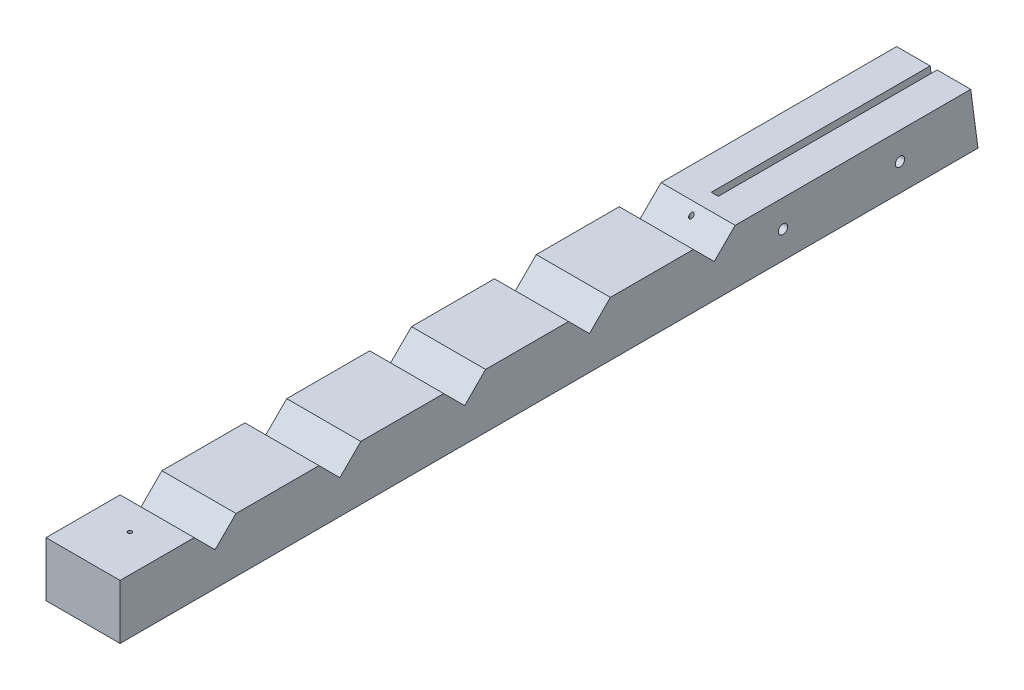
ISO-10303-21;
HEADER;
FILE_DESCRIPTION(('STEP AP214'),'2;1');
FILE_NAME('part.step','',(''),(''),'','','');
FILE_SCHEMA(('AUTOMOTIVE_DESIGN { 1 0 10303 214 1 1 1 1 }'));
ENDSEC;
DATA;
#1=APPLICATION_CONTEXT('core data for automotive mechanical design processes');
#2=APPLICATION_PROTOCOL_DEFINITION('international standard','automotive_design',2000,#1);
#3=PRODUCT_CONTEXT('',#1,'mechanical');
#4=PRODUCT('Part','Part','',(#3));
#5=PRODUCT_RELATED_PRODUCT_CATEGORY('part','',(#4));
#6=PRODUCT_DEFINITION_FORMATION('','',#4);
#7=PRODUCT_DEFINITION_CONTEXT('part definition',#1,'design');
#8=PRODUCT_DEFINITION('design','',#6,#7);
#9=PRODUCT_DEFINITION_SHAPE('','',#8);
#10=(LENGTH_UNIT() NAMED_UNIT(*) SI_UNIT(.MILLI.,.METRE.));
#11=(NAMED_UNIT(*) PLANE_ANGLE_UNIT() SI_UNIT($,.RADIAN.));
#12=(NAMED_UNIT(*) SI_UNIT($,.STERADIAN.) SOLID_ANGLE_UNIT());
#13=UNCERTAINTY_MEASURE_WITH_UNIT(LENGTH_MEASURE(1.E-05),#10,'distance_accuracy_value','');
#14=(GEOMETRIC_REPRESENTATION_CONTEXT(3) GLOBAL_UNCERTAINTY_ASSIGNED_CONTEXT((#13)) GLOBAL_UNIT_ASSIGNED_CONTEXT((#10,
#11,#12)) REPRESENTATION_CONTEXT('',''));
#15=CARTESIAN_POINT('',(0.,0.,0.));
#16=DIRECTION('',(0.,0.,1.));
#17=DIRECTION('',(1.,0.,0.));
#18=AXIS2_PLACEMENT_3D('',#15,#16,#17);
#19=CARTESIAN_POINT('',(-47.5,-5.,1100.));
#20=DIRECTION('',(0.,-1.,0.));
#21=DIRECTION('',(1.,0.,0.));
#22=AXIS2_PLACEMENT_3D('',#19,#20,#21);
#23=PLANE('',#22);
#24=DIRECTION('',(1.,0.,0.));
#25=VECTOR('',#24,1.);
#26=CARTESIAN_POINT('',(-47.5,-5.,9.33333333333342));
#27=LINE('',#26,#25);
#28=CARTESIAN_POINT('',(-47.5,-5.,9.33333333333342));
#29=VERTEX_POINT('',#28);
#30=CARTESIAN_POINT('',(-4.5,-5.00000000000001,9.33333333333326));
#31=VERTEX_POINT('',#30);
#32=EDGE_CURVE('E41',#29,#31,#27,.T.);
#33=ORIENTED_EDGE('',*,*,#32,.F.);
#34=DIRECTION('',(0.,0.,-1.));
#35=VECTOR('',#34,1.);
#36=CARTESIAN_POINT('',(-47.5,-5.,1100.));
#37=LINE('',#36,#35);
#38=CARTESIAN_POINT('',(-47.5,-4.99999999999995,311.360389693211));
#39=VERTEX_POINT('',#38);
#40=EDGE_CURVE('E213',#39,#29,#37,.T.);
#41=ORIENTED_EDGE('',*,*,#40,.F.);
#42=DIRECTION('',(-1.,0.,0.));
#43=VECTOR('',#42,1.);
#44=CARTESIAN_POINT('',(-47.5,-5.,311.360389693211));
#45=LINE('',#44,#43);
#46=CARTESIAN_POINT('',(47.5,-4.99999999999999,311.360389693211));
#47=VERTEX_POINT('',#46);
#48=EDGE_CURVE('E293',#47,#39,#45,.T.);
#49=ORIENTED_EDGE('',*,*,#48,.F.);
#50=DIRECTION('',(0.,0.,-1.));
#51=VECTOR('',#50,1.);
#52=CARTESIAN_POINT('',(47.5,-4.99999999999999,1100.));
#53=LINE('',#52,#51);
#54=CARTESIAN_POINT('',(47.5,-4.99999999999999,9.33333333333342));
#55=VERTEX_POINT('',#54);
#56=EDGE_CURVE('E222',#47,#55,#53,.T.);
#57=ORIENTED_EDGE('',*,*,#56,.T.);
#58=CARTESIAN_POINT('',(4.5,-4.99999999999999,9.33333333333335));
#59=VERTEX_POINT('',#58);
#60=EDGE_CURVE('E186',#59,#55,#27,.T.);
#61=ORIENTED_EDGE('',*,*,#60,.F.);
#62=DIRECTION('',(0.,0.,-1.));
#63=VECTOR('',#62,1.);
#64=CARTESIAN_POINT('',(4.5,-5.,1100.));
#65=LINE('',#64,#63);
#66=CARTESIAN_POINT('',(4.5,-5.,290.));
#67=VERTEX_POINT('',#66);
#68=EDGE_CURVE('E245',#67,#59,#65,.T.);
#69=ORIENTED_EDGE('',*,*,#68,.F.);
#70=DIRECTION('',(-1.,0.,0.));
#71=VECTOR('',#70,1.);
#72=CARTESIAN_POINT('',(-47.5,-5.,290.));
#73=LINE('',#72,#71);
#74=CARTESIAN_POINT('',(-4.5,-5.,290.));
#75=VERTEX_POINT('',#74);
#76=EDGE_CURVE('E261',#67,#75,#73,.T.);
#77=ORIENTED_EDGE('',*,*,#76,.T.);
#78=DIRECTION('',(0.,0.,1.));
#79=VECTOR('',#78,1.);
#80=CARTESIAN_POINT('',(-4.5,-5.,1100.));
#81=LINE('',#80,#79);
#82=EDGE_CURVE('E249',#31,#75,#81,.T.);
#83=ORIENTED_EDGE('',*,*,#82,.F.);
#84=EDGE_LOOP('',(#33,#41,#49,#57,#61,#69,#77,#83));
#85=FACE_BOUND('',#84,.T.);
#86=ADVANCED_FACE('F26',(#85),#23,.F.);
#87=CARTESIAN_POINT('',(47.5,-4.99999999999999,1100.));
#88=DIRECTION('',(-1.,0.,0.));
#89=DIRECTION('',(0.,-1.,0.));
#90=AXIS2_PLACEMENT_3D('',#87,#88,#89);
#91=PLANE('',#90);
#92=CARTESIAN_POINT('',(47.5,-40.,250.));
#93=DIRECTION('',(1.,0.,0.));
#94=DIRECTION('',(0.,0.,-1.));
#95=AXIS2_PLACEMENT_3D('',#92,#93,#94);
#96=CIRCLE('',#95,6.00000000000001);
#97=CARTESIAN_POINT('',(47.5,-40.,244.));
#98=VERTEX_POINT('',#97);
#99=EDGE_CURVE('E267',#98,#98,#96,.T.);
#100=ORIENTED_EDGE('',*,*,#99,.F.);
#101=EDGE_LOOP('',(#100));
#102=FACE_BOUND('',#101,.T.);
#103=CARTESIAN_POINT('',(47.5,-40.,100.));
#104=DIRECTION('',(1.,0.,0.));
#105=DIRECTION('',(0.,0.,-1.));
#106=AXIS2_PLACEMENT_3D('',#103,#104,#105);
#107=CIRCLE('',#106,5.99999999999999);
#108=CARTESIAN_POINT('',(47.5,-40.,94.));
#109=VERTEX_POINT('',#108);
#110=EDGE_CURVE('E273',#109,#109,#107,.T.);
#111=ORIENTED_EDGE('',*,*,#110,.F.);
#112=EDGE_LOOP('',(#111));
#113=FACE_BOUND('',#112,.T.);
#114=DIRECTION('',(0.,-0.991227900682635,-0.132163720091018));
#115=VECTOR('',#114,1.);
#116=CARTESIAN_POINT('',(47.5,137.882096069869,28.3842794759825));
#117=LINE('',#116,#115);
#118=CARTESIAN_POINT('',(47.5000000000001,-75.,0.));
#119=VERTEX_POINT('',#118);
#120=EDGE_CURVE('E181',#55,#119,#117,.T.);
#121=ORIENTED_EDGE('',*,*,#120,.F.);
#122=ORIENTED_EDGE('',*,*,#56,.F.);
#123=DIRECTION('',(0.,0.707106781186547,-0.707106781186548));
#124=VECTOR('',#123,1.);
#125=CARTESIAN_POINT('',(47.5,0.,306.360389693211));
#126=LINE('',#125,#124);
#127=CARTESIAN_POINT('',(47.5,-31.8198051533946,338.180194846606));
#128=VERTEX_POINT('',#127);
#129=EDGE_CURVE('E296',#128,#47,#126,.T.);
#130=ORIENTED_EDGE('',*,*,#129,.F.);
#131=DIRECTION('',(0.,-0.707106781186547,-0.707106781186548));
#132=VECTOR('',#131,1.);
#133=CARTESIAN_POINT('',(47.5,-31.8198051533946,338.180194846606));
#134=LINE('',#133,#132);
#135=CARTESIAN_POINT('',(47.5,-4.99999999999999,365.));
#136=VERTEX_POINT('',#135);
#137=EDGE_CURVE('E287',#136,#128,#134,.T.);
#138=ORIENTED_EDGE('',*,*,#137,.F.);
#139=CARTESIAN_POINT('',(47.5,-4.99999999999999,471.360389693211));
#140=VERTEX_POINT('',#139);
#141=EDGE_CURVE('E397',#140,#136,#53,.T.);
#142=ORIENTED_EDGE('',*,*,#141,.F.);
#143=DIRECTION('',(0.,0.707106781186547,-0.707106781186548));
#144=VECTOR('',#143,1.);
#145=CARTESIAN_POINT('',(47.5,0.,466.360389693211));
#146=LINE('',#145,#144);
#147=CARTESIAN_POINT('',(47.5,-31.8198051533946,498.180194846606));
#148=VERTEX_POINT('',#147);
#149=EDGE_CURVE('E312',#148,#140,#146,.T.);
#150=ORIENTED_EDGE('',*,*,#149,.F.);
#151=DIRECTION('',(0.,-0.707106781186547,-0.707106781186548));
#152=VECTOR('',#151,1.);
#153=CARTESIAN_POINT('',(47.5,-31.8198051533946,498.180194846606));
#154=LINE('',#153,#152);
#155=CARTESIAN_POINT('',(47.5,-4.99999999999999,525.));
#156=VERTEX_POINT('',#155);
#157=EDGE_CURVE('E300',#156,#148,#154,.T.);
#158=ORIENTED_EDGE('',*,*,#157,.F.);
#159=CARTESIAN_POINT('',(47.5,-4.99999999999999,631.360389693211));
#160=VERTEX_POINT('',#159);
#161=EDGE_CURVE('E399',#160,#156,#53,.T.);
#162=ORIENTED_EDGE('',*,*,#161,.F.);
#163=DIRECTION('',(0.,0.707106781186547,-0.707106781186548));
#164=VECTOR('',#163,1.);
#165=CARTESIAN_POINT('',(47.5,0.,626.360389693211));
#166=LINE('',#165,#164);
#167=CARTESIAN_POINT('',(47.5,-31.8198051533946,658.180194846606));
#168=VERTEX_POINT('',#167);
#169=EDGE_CURVE('E328',#168,#160,#166,.T.);
#170=ORIENTED_EDGE('',*,*,#169,.F.);
#171=DIRECTION('',(0.,-0.707106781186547,-0.707106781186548));
#172=VECTOR('',#171,1.);
#173=CARTESIAN_POINT('',(47.5,-31.8198051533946,658.180194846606));
#174=LINE('',#173,#172);
#175=CARTESIAN_POINT('',(47.5,-4.99999999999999,685.));
#176=VERTEX_POINT('',#175);
#177=EDGE_CURVE('E316',#176,#168,#174,.T.);
#178=ORIENTED_EDGE('',*,*,#177,.F.);
#179=CARTESIAN_POINT('',(47.5,-4.99999999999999,791.360389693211));
#180=VERTEX_POINT('',#179);
#181=EDGE_CURVE('E405',#180,#176,#53,.T.);
#182=ORIENTED_EDGE('',*,*,#181,.F.);
#183=DIRECTION('',(0.,0.707106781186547,-0.707106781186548));
#184=VECTOR('',#183,1.);
#185=CARTESIAN_POINT('',(47.5,0.,786.360389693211));
#186=LINE('',#185,#184);
#187=CARTESIAN_POINT('',(47.5,-31.8198051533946,818.180194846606));
#188=VERTEX_POINT('',#187);
#189=EDGE_CURVE('E344',#188,#180,#186,.T.);
#190=ORIENTED_EDGE('',*,*,#189,.F.);
#191=DIRECTION('',(0.,-0.707106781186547,-0.707106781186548));
#192=VECTOR('',#191,1.);
#193=CARTESIAN_POINT('',(47.5,-31.8198051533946,818.180194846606));
#194=LINE('',#193,#192);
#195=CARTESIAN_POINT('',(47.5,-4.99999999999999,845.));
#196=VERTEX_POINT('',#195);
#197=EDGE_CURVE('E332',#196,#188,#194,.T.);
#198=ORIENTED_EDGE('',*,*,#197,.F.);
#199=CARTESIAN_POINT('',(47.5,-4.99999999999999,951.360389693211));
#200=VERTEX_POINT('',#199);
#201=EDGE_CURVE('E227',#200,#196,#53,.T.);
#202=ORIENTED_EDGE('',*,*,#201,.F.);
#203=DIRECTION('',(0.,0.707106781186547,-0.707106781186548));
#204=VECTOR('',#203,1.);
#205=CARTESIAN_POINT('',(47.5,0.,946.360389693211));
#206=LINE('',#205,#204);
#207=CARTESIAN_POINT('',(47.5,-31.8198051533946,978.180194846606));
#208=VERTEX_POINT('',#207);
#209=EDGE_CURVE('E349',#208,#200,#206,.T.);
#210=ORIENTED_EDGE('',*,*,#209,.F.);
#211=DIRECTION('',(0.,-0.707106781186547,-0.707106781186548));
#212=VECTOR('',#211,1.);
#213=CARTESIAN_POINT('',(47.5,-31.8198051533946,978.180194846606));
#214=LINE('',#213,#212);
#215=CARTESIAN_POINT('',(47.5,-4.99999999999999,1005.));
#216=VERTEX_POINT('',#215);
#217=EDGE_CURVE('E351',#216,#208,#214,.T.);
#218=ORIENTED_EDGE('',*,*,#217,.F.);
#219=CARTESIAN_POINT('',(47.5,-4.99999999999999,1100.));
#220=VERTEX_POINT('',#219);
#221=EDGE_CURVE('E224',#220,#216,#53,.T.);
#222=ORIENTED_EDGE('',*,*,#221,.F.);
#223=DIRECTION('',(0.,1.,0.));
#224=VECTOR('',#223,1.);
#225=CARTESIAN_POINT('',(47.5,-4.99999999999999,1100.));
#226=LINE('',#225,#224);
#227=CARTESIAN_POINT('',(47.5,-75.,1100.));
#228=VERTEX_POINT('',#227);
#229=EDGE_CURVE('E208',#228,#220,#226,.T.);
#230=ORIENTED_EDGE('',*,*,#229,.F.);
#231=DIRECTION('',(0.,0.,-1.));
#232=VECTOR('',#231,1.);
#233=CARTESIAN_POINT('',(47.5,-75.,1100.));
#234=LINE('',#233,#232);
#235=EDGE_CURVE('E199',#228,#119,#234,.T.);
#236=ORIENTED_EDGE('',*,*,#235,.T.);
#237=EDGE_LOOP('',(#121,#122,#130,#138,#142,#150,#158,#162,#170,#178,#182,#190,#198,#202,#210,
#218,#222,#230,#236));
#238=FACE_BOUND('',#237,.T.);
#239=ADVANCED_FACE('F28',(#102,#113,#238),#91,.F.);
#240=CARTESIAN_POINT('',(-47.5,-5.,1100.));
#241=DIRECTION('',(1.,0.,0.));
#242=DIRECTION('',(0.,0.,-1.));
#243=AXIS2_PLACEMENT_3D('',#240,#241,#242);
#244=PLANE('',#243);
#245=CARTESIAN_POINT('',(-47.5,-40.,250.));
#246=DIRECTION('',(1.,0.,0.));
#247=DIRECTION('',(0.,0.,-1.));
#248=AXIS2_PLACEMENT_3D('',#245,#246,#247);
#249=CIRCLE('',#248,6.00000000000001);
#250=CARTESIAN_POINT('',(-47.5,-40.,244.));
#251=VERTEX_POINT('',#250);
#252=EDGE_CURVE('E264',#251,#251,#249,.T.);
#253=ORIENTED_EDGE('',*,*,#252,.T.);
#254=EDGE_LOOP('',(#253));
#255=FACE_BOUND('',#254,.T.);
#256=CARTESIAN_POINT('',(-47.5,-40.,100.));
#257=DIRECTION('',(1.,0.,0.));
#258=DIRECTION('',(0.,0.,-1.));
#259=AXIS2_PLACEMENT_3D('',#256,#257,#258);
#260=CIRCLE('',#259,5.99999999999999);
#261=CARTESIAN_POINT('',(-47.5,-40.,94.));
#262=VERTEX_POINT('',#261);
#263=EDGE_CURVE('E270',#262,#262,#260,.T.);
#264=ORIENTED_EDGE('',*,*,#263,.T.);
#265=EDGE_LOOP('',(#264));
#266=FACE_BOUND('',#265,.T.);
#267=DIRECTION('',(0.,0.991227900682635,0.132163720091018));
#268=VECTOR('',#267,1.);
#269=CARTESIAN_POINT('',(-47.5,137.882096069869,28.3842794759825));
#270=LINE('',#269,#268);
#271=CARTESIAN_POINT('',(-47.5000000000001,-75.,0.));
#272=VERTEX_POINT('',#271);
#273=EDGE_CURVE('E371',#272,#29,#270,.T.);
#274=ORIENTED_EDGE('',*,*,#273,.F.);
#275=DIRECTION('',(0.,0.,-1.));
#276=VECTOR('',#275,1.);
#277=CARTESIAN_POINT('',(-47.5,-75.,1100.));
#278=LINE('',#277,#276);
#279=CARTESIAN_POINT('',(-47.5,-75.,1100.));
#280=VERTEX_POINT('',#279);
#281=EDGE_CURVE('E209',#280,#272,#278,.T.);
#282=ORIENTED_EDGE('',*,*,#281,.F.);
#283=DIRECTION('',(0.,-1.,0.));
#284=VECTOR('',#283,1.);
#285=CARTESIAN_POINT('',(-47.5,-5.,1100.));
#286=LINE('',#285,#284);
#287=CARTESIAN_POINT('',(-47.5,-5.,1100.));
#288=VERTEX_POINT('',#287);
#289=EDGE_CURVE('E215',#288,#280,#286,.T.);
#290=ORIENTED_EDGE('',*,*,#289,.F.);
#291=CARTESIAN_POINT('',(-47.5,-4.99999999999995,1005.));
#292=VERTEX_POINT('',#291);
#293=EDGE_CURVE('E219',#288,#292,#37,.T.);
#294=ORIENTED_EDGE('',*,*,#293,.T.);
#295=DIRECTION('',(0.,0.707106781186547,0.707106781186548));
#296=VECTOR('',#295,1.);
#297=CARTESIAN_POINT('',(-47.5,42.4999999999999,1052.5));
#298=LINE('',#297,#296);
#299=CARTESIAN_POINT('',(-47.5,-31.8198051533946,978.180194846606));
#300=VERTEX_POINT('',#299);
#301=EDGE_CURVE('E34',#300,#292,#298,.T.);
#302=ORIENTED_EDGE('',*,*,#301,.F.);
#303=DIRECTION('',(0.,0.707106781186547,-0.707106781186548));
#304=VECTOR('',#303,1.);
#305=CARTESIAN_POINT('',(-47.5,0.,946.360389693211));
#306=LINE('',#305,#304);
#307=CARTESIAN_POINT('',(-47.5,-4.99999999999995,951.360389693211));
#308=VERTEX_POINT('',#307);
#309=EDGE_CURVE('E346',#300,#308,#306,.T.);
#310=ORIENTED_EDGE('',*,*,#309,.T.);
#311=CARTESIAN_POINT('',(-47.5,-4.99999999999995,845.));
#312=VERTEX_POINT('',#311);
#313=EDGE_CURVE('E223',#308,#312,#37,.T.);
#314=ORIENTED_EDGE('',*,*,#313,.T.);
#315=DIRECTION('',(0.,0.707106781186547,0.707106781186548));
#316=VECTOR('',#315,1.);
#317=CARTESIAN_POINT('',(-47.5,42.4999999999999,892.5));
#318=LINE('',#317,#316);
#319=CARTESIAN_POINT('',(-47.5,-31.8198051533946,818.180194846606));
#320=VERTEX_POINT('',#319);
#321=EDGE_CURVE('E337',#320,#312,#318,.T.);
#322=ORIENTED_EDGE('',*,*,#321,.F.);
#323=DIRECTION('',(0.,0.707106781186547,-0.707106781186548));
#324=VECTOR('',#323,1.);
#325=CARTESIAN_POINT('',(-47.5,0.,786.360389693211));
#326=LINE('',#325,#324);
#327=CARTESIAN_POINT('',(-47.5,-4.99999999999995,791.360389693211));
#328=VERTEX_POINT('',#327);
#329=EDGE_CURVE('E341',#320,#328,#326,.T.);
#330=ORIENTED_EDGE('',*,*,#329,.T.);
#331=CARTESIAN_POINT('',(-47.5,-4.99999999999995,685.));
#332=VERTEX_POINT('',#331);
#333=EDGE_CURVE('E436',#328,#332,#37,.T.);
#334=ORIENTED_EDGE('',*,*,#333,.T.);
#335=DIRECTION('',(0.,0.707106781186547,0.707106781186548));
#336=VECTOR('',#335,1.);
#337=CARTESIAN_POINT('',(-47.5,42.4999999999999,732.5));
#338=LINE('',#337,#336);
#339=CARTESIAN_POINT('',(-47.5,-31.8198051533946,658.180194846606));
#340=VERTEX_POINT('',#339);
#341=EDGE_CURVE('E321',#340,#332,#338,.T.);
#342=ORIENTED_EDGE('',*,*,#341,.F.);
#343=DIRECTION('',(0.,0.707106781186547,-0.707106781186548));
#344=VECTOR('',#343,1.);
#345=CARTESIAN_POINT('',(-47.5,0.,626.360389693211));
#346=LINE('',#345,#344);
#347=CARTESIAN_POINT('',(-47.5,-4.99999999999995,631.360389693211));
#348=VERTEX_POINT('',#347);
#349=EDGE_CURVE('E325',#340,#348,#346,.T.);
#350=ORIENTED_EDGE('',*,*,#349,.T.);
#351=CARTESIAN_POINT('',(-47.5,-4.99999999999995,525.));
#352=VERTEX_POINT('',#351);
#353=EDGE_CURVE('E438',#348,#352,#37,.T.);
#354=ORIENTED_EDGE('',*,*,#353,.T.);
#355=DIRECTION('',(0.,0.707106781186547,0.707106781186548));
#356=VECTOR('',#355,1.);
#357=CARTESIAN_POINT('',(-47.5,42.4999999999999,572.5));
#358=LINE('',#357,#356);
#359=CARTESIAN_POINT('',(-47.5,-31.8198051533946,498.180194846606));
#360=VERTEX_POINT('',#359);
#361=EDGE_CURVE('E305',#360,#352,#358,.T.);
#362=ORIENTED_EDGE('',*,*,#361,.F.);
#363=DIRECTION('',(0.,0.707106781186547,-0.707106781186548));
#364=VECTOR('',#363,1.);
#365=CARTESIAN_POINT('',(-47.5,0.,466.360389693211));
#366=LINE('',#365,#364);
#367=CARTESIAN_POINT('',(-47.5,-4.99999999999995,471.360389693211));
#368=VERTEX_POINT('',#367);
#369=EDGE_CURVE('E309',#360,#368,#366,.T.);
#370=ORIENTED_EDGE('',*,*,#369,.T.);
#371=CARTESIAN_POINT('',(-47.5,-4.99999999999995,365.));
#372=VERTEX_POINT('',#371);
#373=EDGE_CURVE('E440',#368,#372,#37,.T.);
#374=ORIENTED_EDGE('',*,*,#373,.T.);
#375=DIRECTION('',(0.,0.707106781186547,0.707106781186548));
#376=VECTOR('',#375,1.);
#377=CARTESIAN_POINT('',(-47.5,42.4999999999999,412.5));
#378=LINE('',#377,#376);
#379=CARTESIAN_POINT('',(-47.5,-31.8198051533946,338.180194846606));
#380=VERTEX_POINT('',#379);
#381=EDGE_CURVE('E291',#380,#372,#378,.T.);
#382=ORIENTED_EDGE('',*,*,#381,.F.);
#383=DIRECTION('',(0.,0.707106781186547,-0.707106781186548));
#384=VECTOR('',#383,1.);
#385=CARTESIAN_POINT('',(-47.5,0.,306.360389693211));
#386=LINE('',#385,#384);
#387=EDGE_CURVE('E49',#380,#39,#386,.T.);
#388=ORIENTED_EDGE('',*,*,#387,.T.);
#389=ORIENTED_EDGE('',*,*,#40,.T.);
#390=EDGE_LOOP('',(#274,#282,#290,#294,#302,#310,#314,#322,#330,#334,#342,#350,#354,#362,#370,
#374,#382,#388,#389));
#391=FACE_BOUND('',#390,.T.);
#392=ADVANCED_FACE('F369',(#255,#266,#391),#244,.F.);
#393=CARTESIAN_POINT('',(-4.5,75.,290.));
#394=DIRECTION('',(1.,0.,0.));
#395=DIRECTION('',(0.,0.,-1.));
#396=AXIS2_PLACEMENT_3D('',#393,#394,#395);
#397=PLANE('',#396);
#398=CARTESIAN_POINT('',(-4.5,-40.,100.));
#399=DIRECTION('',(1.,0.,0.));
#400=DIRECTION('',(0.,0.,-1.));
#401=AXIS2_PLACEMENT_3D('',#398,#399,#400);
#402=CIRCLE('',#401,5.99999999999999);
#403=CARTESIAN_POINT('',(-4.5,-40.,94.));
#404=VERTEX_POINT('',#403);
#405=EDGE_CURVE('E244',#404,#404,#402,.T.);
#406=ORIENTED_EDGE('',*,*,#405,.F.);
#407=EDGE_LOOP('',(#406));
#408=FACE_BOUND('',#407,.T.);
#409=CARTESIAN_POINT('',(-4.5,-40.,250.));
#410=DIRECTION('',(1.,0.,0.));
#411=DIRECTION('',(0.,0.,-1.));
#412=AXIS2_PLACEMENT_3D('',#409,#410,#411);
#413=CIRCLE('',#412,6.00000000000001);
#414=CARTESIAN_POINT('',(-4.5,-40.,244.));
#415=VERTEX_POINT('',#414);
#416=EDGE_CURVE('E242',#415,#415,#413,.T.);
#417=ORIENTED_EDGE('',*,*,#416,.F.);
#418=EDGE_LOOP('',(#417));
#419=FACE_BOUND('',#418,.T.);
#420=DIRECTION('',(0.,0.,-1.));
#421=VECTOR('',#420,1.);
#422=CARTESIAN_POINT('',(-4.5,-75.,290.));
#423=LINE('',#422,#421);
#424=CARTESIAN_POINT('',(-4.5,-75.,290.));
#425=VERTEX_POINT('',#424);
#426=CARTESIAN_POINT('',(-4.49999999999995,-75.,0.));
#427=VERTEX_POINT('',#426);
#428=EDGE_CURVE('E241',#425,#427,#423,.T.);
#429=ORIENTED_EDGE('',*,*,#428,.T.);
#430=DIRECTION('',(0.,0.991227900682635,0.132163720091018));
#431=VECTOR('',#430,1.);
#432=CARTESIAN_POINT('',(-4.5,110.371179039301,24.7161572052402));
#433=LINE('',#432,#431);
#434=EDGE_CURVE('E191',#427,#31,#433,.T.);
#435=ORIENTED_EDGE('',*,*,#434,.T.);
#436=ORIENTED_EDGE('',*,*,#82,.T.);
#437=DIRECTION('',(0.,-1.,0.));
#438=VECTOR('',#437,1.);
#439=CARTESIAN_POINT('',(-4.5,75.,290.));
#440=LINE('',#439,#438);
#441=EDGE_CURVE('E379',#75,#425,#440,.T.);
#442=ORIENTED_EDGE('',*,*,#441,.T.);
#443=EDGE_LOOP('',(#429,#435,#436,#442));
#444=FACE_BOUND('',#443,.T.);
#445=ADVANCED_FACE('F377',(#408,#419,#444),#397,.T.);
#446=CARTESIAN_POINT('',(4.5,-75.,290.));
#447=DIRECTION('',(-1.,0.,0.));
#448=DIRECTION('',(0.,0.,1.));
#449=AXIS2_PLACEMENT_3D('',#446,#447,#448);
#450=PLANE('',#449);
#451=CARTESIAN_POINT('',(4.5,-40.,100.));
#452=DIRECTION('',(-1.,0.,0.));
#453=DIRECTION('',(0.,0.,1.));
#454=AXIS2_PLACEMENT_3D('',#451,#452,#453);
#455=CIRCLE('',#454,5.99999999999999);
#456=CARTESIAN_POINT('',(4.5,-40.,106.));
#457=VERTEX_POINT('',#456);
#458=EDGE_CURVE('E240',#457,#457,#455,.T.);
#459=ORIENTED_EDGE('',*,*,#458,.F.);
#460=EDGE_LOOP('',(#459));
#461=FACE_BOUND('',#460,.T.);
#462=CARTESIAN_POINT('',(4.5,-40.,250.));
#463=DIRECTION('',(-1.,0.,0.));
#464=DIRECTION('',(0.,0.,1.));
#465=AXIS2_PLACEMENT_3D('',#462,#463,#464);
#466=CIRCLE('',#465,6.00000000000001);
#467=CARTESIAN_POINT('',(4.5,-40.,256.));
#468=VERTEX_POINT('',#467);
#469=EDGE_CURVE('E238',#468,#468,#466,.T.);
#470=ORIENTED_EDGE('',*,*,#469,.F.);
#471=EDGE_LOOP('',(#470));
#472=FACE_BOUND('',#471,.T.);
#473=ORIENTED_EDGE('',*,*,#68,.T.);
#474=DIRECTION('',(0.,-0.991227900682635,-0.132163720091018));
#475=VECTOR('',#474,1.);
#476=CARTESIAN_POINT('',(4.5,-37.0087336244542,5.06550218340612));
#477=LINE('',#476,#475);
#478=CARTESIAN_POINT('',(4.5,-75.,0.));
#479=VERTEX_POINT('',#478);
#480=EDGE_CURVE('E11',#59,#479,#477,.T.);
#481=ORIENTED_EDGE('',*,*,#480,.T.);
#482=DIRECTION('',(0.,0.,-1.));
#483=VECTOR('',#482,1.);
#484=CARTESIAN_POINT('',(4.5,-75.,290.));
#485=LINE('',#484,#483);
#486=CARTESIAN_POINT('',(4.5,-75.,290.));
#487=VERTEX_POINT('',#486);
#488=EDGE_CURVE('E202',#487,#479,#485,.T.);
#489=ORIENTED_EDGE('',*,*,#488,.F.);
#490=DIRECTION('',(0.,1.,0.));
#491=VECTOR('',#490,1.);
#492=CARTESIAN_POINT('',(4.5,-75.,290.));
#493=LINE('',#492,#491);
#494=EDGE_CURVE('E381',#487,#67,#493,.T.);
#495=ORIENTED_EDGE('',*,*,#494,.T.);
#496=EDGE_LOOP('',(#473,#481,#489,#495));
#497=FACE_BOUND('',#496,.T.);
#498=ADVANCED_FACE('F392',(#461,#472,#497),#450,.T.);
#499=CARTESIAN_POINT('',(47.5,-75.,1100.));
#500=DIRECTION('',(0.,1.,0.));
#501=DIRECTION('',(-1.,0.,0.));
#502=AXIS2_PLACEMENT_3D('',#499,#500,#501);
#503=PLANE('',#502);
#504=CARTESIAN_POINT('',(0.,-75.,1040.));
#505=DIRECTION('',(0.,1.,0.));
#506=DIRECTION('',(-1.,0.,0.));
#507=AXIS2_PLACEMENT_3D('',#504,#505,#506);
#508=CIRCLE('',#507,2.49999999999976);
#509=CARTESIAN_POINT('',(-2.49999999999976,-75.,1040.));
#510=VERTEX_POINT('',#509);
#511=EDGE_CURVE('E232',#510,#510,#508,.F.);
#512=ORIENTED_EDGE('',*,*,#511,.F.);
#513=EDGE_LOOP('',(#512));
#514=FACE_BOUND('',#513,.T.);
#515=CARTESIAN_POINT('',(0.,-75.,680.));
#516=DIRECTION('',(0.,1.,0.));
#517=DIRECTION('',(-1.,0.,0.));
#518=AXIS2_PLACEMENT_3D('',#515,#516,#517);
#519=CIRCLE('',#518,2.49999999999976);
#520=CARTESIAN_POINT('',(-2.49999999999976,-75.,680.));
#521=VERTEX_POINT('',#520);
#522=EDGE_CURVE('E233',#521,#521,#519,.F.);
#523=ORIENTED_EDGE('',*,*,#522,.F.);
#524=EDGE_LOOP('',(#523));
#525=FACE_BOUND('',#524,.T.);
#526=CARTESIAN_POINT('',(0.,-75.,320.));
#527=DIRECTION('',(0.,1.,0.));
#528=DIRECTION('',(-1.,0.,0.));
#529=AXIS2_PLACEMENT_3D('',#526,#527,#528);
#530=CIRCLE('',#529,2.49999999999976);
#531=CARTESIAN_POINT('',(-2.49999999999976,-75.,320.));
#532=VERTEX_POINT('',#531);
#533=EDGE_CURVE('E237',#532,#532,#530,.F.);
#534=ORIENTED_EDGE('',*,*,#533,.F.);
#535=EDGE_LOOP('',(#534));
#536=FACE_BOUND('',#535,.T.);
#537=ORIENTED_EDGE('',*,*,#428,.F.);
#538=DIRECTION('',(1.,0.,0.));
#539=VECTOR('',#538,1.);
#540=CARTESIAN_POINT('',(-4.5,-75.,290.));
#541=LINE('',#540,#539);
#542=EDGE_CURVE('E385',#425,#487,#541,.T.);
#543=ORIENTED_EDGE('',*,*,#542,.T.);
#544=ORIENTED_EDGE('',*,*,#488,.T.);
#545=DIRECTION('',(1.,0.,0.));
#546=VECTOR('',#545,1.);
#547=CARTESIAN_POINT('',(47.5,-75.,0.));
#548=LINE('',#547,#546);
#549=EDGE_CURVE('E184',#479,#119,#548,.T.);
#550=ORIENTED_EDGE('',*,*,#549,.T.);
#551=ORIENTED_EDGE('',*,*,#235,.F.);
#552=DIRECTION('',(1.,0.,0.));
#553=VECTOR('',#552,1.);
#554=CARTESIAN_POINT('',(47.5,-75.,1100.));
#555=LINE('',#554,#553);
#556=EDGE_CURVE('E210',#280,#228,#555,.T.);
#557=ORIENTED_EDGE('',*,*,#556,.F.);
#558=ORIENTED_EDGE('',*,*,#281,.T.);
#559=EDGE_CURVE('E203',#272,#427,#548,.T.);
#560=ORIENTED_EDGE('',*,*,#559,.T.);
#561=EDGE_LOOP('',(#537,#543,#544,#550,#551,#557,#558,#560));
#562=FACE_BOUND('',#561,.T.);
#563=ADVANCED_FACE('F197',(#514,#525,#536,#562),#503,.F.);
#564=CARTESIAN_POINT('',(47.5,-40.,100.));
#565=DIRECTION('',(-1.,0.,0.));
#566=DIRECTION('',(0.,0.,1.));
#567=AXIS2_PLACEMENT_3D('',#564,#565,#566);
#568=CYLINDRICAL_SURFACE('',#567,5.99999999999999);
#569=ORIENTED_EDGE('',*,*,#263,.F.);
#570=EDGE_LOOP('',(#569));
#571=FACE_BOUND('',#570,.T.);
#572=ORIENTED_EDGE('',*,*,#405,.T.);
#573=EDGE_LOOP('',(#572));
#574=FACE_BOUND('',#573,.T.);
#575=ADVANCED_FACE('F511',(#571,#574),#568,.F.);
#576=ORIENTED_EDGE('',*,*,#110,.T.);
#577=EDGE_LOOP('',(#576));
#578=FACE_BOUND('',#577,.T.);
#579=ORIENTED_EDGE('',*,*,#458,.T.);
#580=EDGE_LOOP('',(#579));
#581=FACE_BOUND('',#580,.T.);
#582=ADVANCED_FACE('F526',(#578,#581),#568,.F.);
#583=CARTESIAN_POINT('',(47.5,-40.,250.));
#584=DIRECTION('',(-1.,0.,0.));
#585=DIRECTION('',(0.,0.,1.));
#586=AXIS2_PLACEMENT_3D('',#583,#584,#585);
#587=CYLINDRICAL_SURFACE('',#586,6.00000000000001);
#588=ORIENTED_EDGE('',*,*,#252,.F.);
#589=EDGE_LOOP('',(#588));
#590=FACE_BOUND('',#589,.T.);
#591=ORIENTED_EDGE('',*,*,#416,.T.);
#592=EDGE_LOOP('',(#591));
#593=FACE_BOUND('',#592,.T.);
#594=ADVANCED_FACE('F534',(#590,#593),#587,.F.);
#595=ORIENTED_EDGE('',*,*,#99,.T.);
#596=EDGE_LOOP('',(#595));
#597=FACE_BOUND('',#596,.T.);
#598=ORIENTED_EDGE('',*,*,#469,.T.);
#599=EDGE_LOOP('',(#598));
#600=FACE_BOUND('',#599,.T.);
#601=ADVANCED_FACE('F485',(#597,#600),#587,.F.);
#602=DIRECTION('',(1.,0.,0.));
#603=VECTOR('',#602,1.);
#604=CARTESIAN_POINT('',(-47.5,-5.,365.));
#605=LINE('',#604,#603);
#606=EDGE_CURVE('E285',#372,#136,#605,.T.);
#607=ORIENTED_EDGE('',*,*,#606,.F.);
#608=ORIENTED_EDGE('',*,*,#373,.F.);
#609=DIRECTION('',(-1.,0.,0.));
#610=VECTOR('',#609,1.);
#611=CARTESIAN_POINT('',(-47.5,-5.,471.360389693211));
#612=LINE('',#611,#610);
#613=EDGE_CURVE('E307',#140,#368,#612,.T.);
#614=ORIENTED_EDGE('',*,*,#613,.F.);
#615=ORIENTED_EDGE('',*,*,#141,.T.);
#616=EDGE_LOOP('',(#607,#608,#614,#615));
#617=FACE_BOUND('',#616,.T.);
#618=ADVANCED_FACE('F449',(#617),#23,.F.);
#619=DIRECTION('',(1.,0.,0.));
#620=VECTOR('',#619,1.);
#621=CARTESIAN_POINT('',(-47.5,-5.,525.));
#622=LINE('',#621,#620);
#623=EDGE_CURVE('E298',#352,#156,#622,.T.);
#624=ORIENTED_EDGE('',*,*,#623,.F.);
#625=ORIENTED_EDGE('',*,*,#353,.F.);
#626=DIRECTION('',(-1.,0.,0.));
#627=VECTOR('',#626,1.);
#628=CARTESIAN_POINT('',(-47.5,-5.,631.360389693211));
#629=LINE('',#628,#627);
#630=EDGE_CURVE('E323',#160,#348,#629,.T.);
#631=ORIENTED_EDGE('',*,*,#630,.F.);
#632=ORIENTED_EDGE('',*,*,#161,.T.);
#633=EDGE_LOOP('',(#624,#625,#631,#632));
#634=FACE_BOUND('',#633,.T.);
#635=ADVANCED_FACE('F484',(#634),#23,.F.);
#636=DIRECTION('',(1.,0.,0.));
#637=VECTOR('',#636,1.);
#638=CARTESIAN_POINT('',(-47.5,-5.,685.));
#639=LINE('',#638,#637);
#640=EDGE_CURVE('E314',#332,#176,#639,.T.);
#641=ORIENTED_EDGE('',*,*,#640,.F.);
#642=ORIENTED_EDGE('',*,*,#333,.F.);
#643=DIRECTION('',(-1.,0.,0.));
#644=VECTOR('',#643,1.);
#645=CARTESIAN_POINT('',(-47.5,-5.,791.360389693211));
#646=LINE('',#645,#644);
#647=EDGE_CURVE('E339',#180,#328,#646,.T.);
#648=ORIENTED_EDGE('',*,*,#647,.F.);
#649=ORIENTED_EDGE('',*,*,#181,.T.);
#650=EDGE_LOOP('',(#641,#642,#648,#649));
#651=FACE_BOUND('',#650,.T.);
#652=ADVANCED_FACE('F437',(#651),#23,.F.);
#653=DIRECTION('',(1.,0.,0.));
#654=VECTOR('',#653,1.);
#655=CARTESIAN_POINT('',(-47.5,-5.,845.));
#656=LINE('',#655,#654);
#657=EDGE_CURVE('E330',#312,#196,#656,.T.);
#658=ORIENTED_EDGE('',*,*,#657,.F.);
#659=ORIENTED_EDGE('',*,*,#313,.F.);
#660=DIRECTION('',(-1.,0.,0.));
#661=VECTOR('',#660,1.);
#662=CARTESIAN_POINT('',(-47.5,-5.,951.360389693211));
#663=LINE('',#662,#661);
#664=EDGE_CURVE('E204',#200,#308,#663,.T.);
#665=ORIENTED_EDGE('',*,*,#664,.F.);
#666=ORIENTED_EDGE('',*,*,#201,.T.);
#667=EDGE_LOOP('',(#658,#659,#665,#666));
#668=FACE_BOUND('',#667,.T.);
#669=ADVANCED_FACE('F420',(#668),#23,.F.);
#670=CARTESIAN_POINT('',(0.,-5.,1040.));
#671=DIRECTION('',(0.,-1.,0.));
#672=DIRECTION('',(1.,0.,0.));
#673=AXIS2_PLACEMENT_3D('',#670,#671,#672);
#674=CIRCLE('',#673,2.49999999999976);
#675=CARTESIAN_POINT('',(2.49999999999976,-5.,1040.));
#676=VERTEX_POINT('',#675);
#677=EDGE_CURVE('E282',#676,#676,#674,.F.);
#678=ORIENTED_EDGE('',*,*,#677,.F.);
#679=EDGE_LOOP('',(#678));
#680=FACE_BOUND('',#679,.T.);
#681=DIRECTION('',(1.,0.,0.));
#682=VECTOR('',#681,1.);
#683=CARTESIAN_POINT('',(-47.5,-5.,1005.));
#684=LINE('',#683,#682);
#685=EDGE_CURVE('E356',#292,#216,#684,.T.);
#686=ORIENTED_EDGE('',*,*,#685,.F.);
#687=ORIENTED_EDGE('',*,*,#293,.F.);
#688=DIRECTION('',(-1.,0.,0.));
#689=VECTOR('',#688,1.);
#690=CARTESIAN_POINT('',(-47.5,-5.,1100.));
#691=LINE('',#690,#689);
#692=EDGE_CURVE('E361',#220,#288,#691,.T.);
#693=ORIENTED_EDGE('',*,*,#692,.F.);
#694=ORIENTED_EDGE('',*,*,#221,.T.);
#695=EDGE_LOOP('',(#686,#687,#693,#694));
#696=FACE_BOUND('',#695,.T.);
#697=ADVANCED_FACE('F476',(#680,#696),#23,.F.);
#698=CARTESIAN_POINT('',(47.5,-75.,1100.));
#699=DIRECTION('',(0.,0.,-1.));
#700=DIRECTION('',(-1.,0.,0.));
#701=AXIS2_PLACEMENT_3D('',#698,#699,#700);
#702=PLANE('',#701);
#703=ORIENTED_EDGE('',*,*,#229,.T.);
#704=ORIENTED_EDGE('',*,*,#692,.T.);
#705=ORIENTED_EDGE('',*,*,#289,.T.);
#706=ORIENTED_EDGE('',*,*,#556,.T.);
#707=EDGE_LOOP('',(#703,#704,#705,#706));
#708=FACE_BOUND('',#707,.T.);
#709=ADVANCED_FACE('F365',(#708),#702,.F.);
#710=CARTESIAN_POINT('',(47.5,0.,946.360389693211));
#711=DIRECTION('',(0.,0.707106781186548,0.707106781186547));
#712=DIRECTION('',(0.,-0.707106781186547,0.707106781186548));
#713=AXIS2_PLACEMENT_3D('',#710,#711,#712);
#714=PLANE('',#713);
#715=ORIENTED_EDGE('',*,*,#664,.T.);
#716=ORIENTED_EDGE('',*,*,#309,.F.);
#717=DIRECTION('',(-1.,0.,0.));
#718=VECTOR('',#717,1.);
#719=CARTESIAN_POINT('',(47.5,-31.8198051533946,978.180194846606));
#720=LINE('',#719,#718);
#721=EDGE_CURVE('E353',#208,#300,#720,.T.);
#722=ORIENTED_EDGE('',*,*,#721,.F.);
#723=ORIENTED_EDGE('',*,*,#209,.T.);
#724=EDGE_LOOP('',(#715,#716,#722,#723));
#725=FACE_BOUND('',#724,.T.);
#726=ADVANCED_FACE('F491',(#725),#714,.T.);
#727=CARTESIAN_POINT('',(47.5,-31.8198051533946,978.180194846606));
#728=DIRECTION('',(0.,0.707106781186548,-0.707106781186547));
#729=DIRECTION('',(0.,0.707106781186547,0.707106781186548));
#730=AXIS2_PLACEMENT_3D('',#727,#728,#729);
#731=PLANE('',#730);
#732=ORIENTED_EDGE('',*,*,#685,.T.);
#733=ORIENTED_EDGE('',*,*,#217,.T.);
#734=ORIENTED_EDGE('',*,*,#721,.T.);
#735=ORIENTED_EDGE('',*,*,#301,.T.);
#736=EDGE_LOOP('',(#732,#733,#734,#735));
#737=FACE_BOUND('',#736,.T.);
#738=ADVANCED_FACE('F499',(#737),#731,.T.);
#739=CARTESIAN_POINT('',(47.5,0.,786.360389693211));
#740=DIRECTION('',(0.,0.707106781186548,0.707106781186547));
#741=DIRECTION('',(0.,-0.707106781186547,0.707106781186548));
#742=AXIS2_PLACEMENT_3D('',#739,#740,#741);
#743=PLANE('',#742);
#744=ORIENTED_EDGE('',*,*,#647,.T.);
#745=ORIENTED_EDGE('',*,*,#329,.F.);
#746=DIRECTION('',(-1.,0.,0.));
#747=VECTOR('',#746,1.);
#748=CARTESIAN_POINT('',(47.5,-31.8198051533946,818.180194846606));
#749=LINE('',#748,#747);
#750=EDGE_CURVE('E334',#188,#320,#749,.T.);
#751=ORIENTED_EDGE('',*,*,#750,.F.);
#752=ORIENTED_EDGE('',*,*,#189,.T.);
#753=EDGE_LOOP('',(#744,#745,#751,#752));
#754=FACE_BOUND('',#753,.T.);
#755=ADVANCED_FACE('F432',(#754),#743,.T.);
#756=CARTESIAN_POINT('',(47.5,-31.8198051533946,818.180194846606));
#757=DIRECTION('',(0.,0.707106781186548,-0.707106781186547));
#758=DIRECTION('',(0.,0.707106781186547,0.707106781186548));
#759=AXIS2_PLACEMENT_3D('',#756,#757,#758);
#760=PLANE('',#759);
#761=ORIENTED_EDGE('',*,*,#657,.T.);
#762=ORIENTED_EDGE('',*,*,#197,.T.);
#763=ORIENTED_EDGE('',*,*,#750,.T.);
#764=ORIENTED_EDGE('',*,*,#321,.T.);
#765=EDGE_LOOP('',(#761,#762,#763,#764));
#766=FACE_BOUND('',#765,.T.);
#767=ADVANCED_FACE('F429',(#766),#760,.T.);
#768=CARTESIAN_POINT('',(47.5,0.,626.360389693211));
#769=DIRECTION('',(0.,0.707106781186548,0.707106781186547));
#770=DIRECTION('',(0.,-0.707106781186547,0.707106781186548));
#771=AXIS2_PLACEMENT_3D('',#768,#769,#770);
#772=PLANE('',#771);
#773=ORIENTED_EDGE('',*,*,#630,.T.);
#774=ORIENTED_EDGE('',*,*,#349,.F.);
#775=DIRECTION('',(-1.,0.,0.));
#776=VECTOR('',#775,1.);
#777=CARTESIAN_POINT('',(47.5,-31.8198051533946,658.180194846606));
#778=LINE('',#777,#776);
#779=EDGE_CURVE('E318',#168,#340,#778,.T.);
#780=ORIENTED_EDGE('',*,*,#779,.F.);
#781=ORIENTED_EDGE('',*,*,#169,.T.);
#782=EDGE_LOOP('',(#773,#774,#780,#781));
#783=FACE_BOUND('',#782,.T.);
#784=ADVANCED_FACE('F469',(#783),#772,.T.);
#785=CARTESIAN_POINT('',(47.5,-31.8198051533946,658.180194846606));
#786=DIRECTION('',(0.,0.707106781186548,-0.707106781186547));
#787=DIRECTION('',(0.,0.707106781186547,0.707106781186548));
#788=AXIS2_PLACEMENT_3D('',#785,#786,#787);
#789=PLANE('',#788);
#790=CARTESIAN_POINT('',(0.,-10.0000000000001,680.));
#791=DIRECTION('',(0.,0.707106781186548,-0.707106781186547));
#792=DIRECTION('',(0.,0.707106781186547,0.707106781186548));
#793=AXIS2_PLACEMENT_3D('',#790,#791,#792);
#794=ELLIPSE('',#793,3.53553390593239,2.49999999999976);
#795=CARTESIAN_POINT('',(0.,-7.50000000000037,682.5));
#796=VERTEX_POINT('',#795);
#797=EDGE_CURVE('E229',#796,#796,#794,.T.);
#798=ORIENTED_EDGE('',*,*,#797,.F.);
#799=EDGE_LOOP('',(#798));
#800=FACE_BOUND('',#799,.T.);
#801=ORIENTED_EDGE('',*,*,#640,.T.);
#802=ORIENTED_EDGE('',*,*,#177,.T.);
#803=ORIENTED_EDGE('',*,*,#779,.T.);
#804=ORIENTED_EDGE('',*,*,#341,.T.);
#805=EDGE_LOOP('',(#801,#802,#803,#804));
#806=FACE_BOUND('',#805,.T.);
#807=ADVANCED_FACE('F552',(#800,#806),#789,.T.);
#808=CARTESIAN_POINT('',(47.5,0.,466.360389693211));
#809=DIRECTION('',(0.,0.707106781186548,0.707106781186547));
#810=DIRECTION('',(0.,-0.707106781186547,0.707106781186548));
#811=AXIS2_PLACEMENT_3D('',#808,#809,#810);
#812=PLANE('',#811);
#813=ORIENTED_EDGE('',*,*,#613,.T.);
#814=ORIENTED_EDGE('',*,*,#369,.F.);
#815=DIRECTION('',(-1.,0.,0.));
#816=VECTOR('',#815,1.);
#817=CARTESIAN_POINT('',(47.5,-31.8198051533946,498.180194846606));
#818=LINE('',#817,#816);
#819=EDGE_CURVE('E302',#148,#360,#818,.T.);
#820=ORIENTED_EDGE('',*,*,#819,.F.);
#821=ORIENTED_EDGE('',*,*,#149,.T.);
#822=EDGE_LOOP('',(#813,#814,#820,#821));
#823=FACE_BOUND('',#822,.T.);
#824=ADVANCED_FACE('F465',(#823),#812,.T.);
#825=CARTESIAN_POINT('',(47.5,-31.8198051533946,498.180194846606));
#826=DIRECTION('',(0.,0.707106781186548,-0.707106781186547));
#827=DIRECTION('',(0.,0.707106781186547,0.707106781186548));
#828=AXIS2_PLACEMENT_3D('',#825,#826,#827);
#829=PLANE('',#828);
#830=ORIENTED_EDGE('',*,*,#623,.T.);
#831=ORIENTED_EDGE('',*,*,#157,.T.);
#832=ORIENTED_EDGE('',*,*,#819,.T.);
#833=ORIENTED_EDGE('',*,*,#361,.T.);
#834=EDGE_LOOP('',(#830,#831,#832,#833));
#835=FACE_BOUND('',#834,.T.);
#836=ADVANCED_FACE('F455',(#835),#829,.T.);
#837=CARTESIAN_POINT('',(47.5,0.,306.360389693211));
#838=DIRECTION('',(0.,0.707106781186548,0.707106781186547));
#839=DIRECTION('',(0.,-0.707106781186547,0.707106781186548));
#840=AXIS2_PLACEMENT_3D('',#837,#838,#839);
#841=PLANE('',#840);
#842=CARTESIAN_POINT('',(0.,-13.6396103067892,320.));
#843=DIRECTION('',(0.,0.707106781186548,0.707106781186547));
#844=DIRECTION('',(0.,0.707106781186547,-0.707106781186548));
#845=AXIS2_PLACEMENT_3D('',#842,#843,#844);
#846=ELLIPSE('',#845,3.53553390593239,2.49999999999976);
#847=CARTESIAN_POINT('',(0.,-11.1396103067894,317.5));
#848=VERTEX_POINT('',#847);
#849=EDGE_CURVE('E234',#848,#848,#846,.T.);
#850=ORIENTED_EDGE('',*,*,#849,.F.);
#851=EDGE_LOOP('',(#850));
#852=FACE_BOUND('',#851,.T.);
#853=ORIENTED_EDGE('',*,*,#48,.T.);
#854=ORIENTED_EDGE('',*,*,#387,.F.);
#855=DIRECTION('',(-1.,0.,0.));
#856=VECTOR('',#855,1.);
#857=CARTESIAN_POINT('',(47.5,-31.8198051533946,338.180194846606));
#858=LINE('',#857,#856);
#859=EDGE_CURVE('E289',#128,#380,#858,.T.);
#860=ORIENTED_EDGE('',*,*,#859,.F.);
#861=ORIENTED_EDGE('',*,*,#129,.T.);
#862=EDGE_LOOP('',(#853,#854,#860,#861));
#863=FACE_BOUND('',#862,.T.);
#864=ADVANCED_FACE('F453',(#852,#863),#841,.T.);
#865=CARTESIAN_POINT('',(47.5,-31.8198051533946,338.180194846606));
#866=DIRECTION('',(0.,0.707106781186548,-0.707106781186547));
#867=DIRECTION('',(0.,0.707106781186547,0.707106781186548));
#868=AXIS2_PLACEMENT_3D('',#865,#866,#867);
#869=PLANE('',#868);
#870=ORIENTED_EDGE('',*,*,#606,.T.);
#871=ORIENTED_EDGE('',*,*,#137,.T.);
#872=ORIENTED_EDGE('',*,*,#859,.T.);
#873=ORIENTED_EDGE('',*,*,#381,.T.);
#874=EDGE_LOOP('',(#870,#871,#872,#873));
#875=FACE_BOUND('',#874,.T.);
#876=ADVANCED_FACE('F447',(#875),#869,.T.);
#877=CARTESIAN_POINT('',(0.,-75.001,1040.));
#878=DIRECTION('',(0.,1.,0.));
#879=DIRECTION('',(0.,0.,1.));
#880=AXIS2_PLACEMENT_3D('',#877,#878,#879);
#881=CYLINDRICAL_SURFACE('',#880,2.49999999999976);
#882=ORIENTED_EDGE('',*,*,#511,.T.);
#883=EDGE_LOOP('',(#882));
#884=FACE_BOUND('',#883,.T.);
#885=ORIENTED_EDGE('',*,*,#677,.T.);
#886=EDGE_LOOP('',(#885));
#887=FACE_BOUND('',#886,.T.);
#888=ADVANCED_FACE('F458',(#884,#887),#881,.F.);
#889=CARTESIAN_POINT('',(0.,-75.001,680.));
#890=DIRECTION('',(0.,1.,0.));
#891=DIRECTION('',(0.,0.,1.));
#892=AXIS2_PLACEMENT_3D('',#889,#890,#891);
#893=CYLINDRICAL_SURFACE('',#892,2.49999999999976);
#894=ORIENTED_EDGE('',*,*,#797,.T.);
#895=EDGE_LOOP('',(#894));
#896=FACE_BOUND('',#895,.T.);
#897=ORIENTED_EDGE('',*,*,#522,.T.);
#898=EDGE_LOOP('',(#897));
#899=FACE_BOUND('',#898,.T.);
#900=ADVANCED_FACE('F472',(#896,#899),#893,.F.);
#901=CARTESIAN_POINT('',(0.,-75.001,320.));
#902=DIRECTION('',(0.,1.,0.));
#903=DIRECTION('',(0.,0.,1.));
#904=AXIS2_PLACEMENT_3D('',#901,#902,#903);
#905=CYLINDRICAL_SURFACE('',#904,2.49999999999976);
#906=ORIENTED_EDGE('',*,*,#849,.T.);
#907=EDGE_LOOP('',(#906));
#908=FACE_BOUND('',#907,.T.);
#909=ORIENTED_EDGE('',*,*,#533,.T.);
#910=EDGE_LOOP('',(#909));
#911=FACE_BOUND('',#910,.T.);
#912=ADVANCED_FACE('F538',(#908,#911),#905,.F.);
#913=CARTESIAN_POINT('',(-4.5,-75.,290.));
#914=DIRECTION('',(0.,0.,1.));
#915=DIRECTION('',(1.,0.,0.));
#916=AXIS2_PLACEMENT_3D('',#913,#914,#915);
#917=PLANE('',#916);
#918=ORIENTED_EDGE('',*,*,#494,.F.);
#919=ORIENTED_EDGE('',*,*,#542,.F.);
#920=ORIENTED_EDGE('',*,*,#441,.F.);
#921=ORIENTED_EDGE('',*,*,#76,.F.);
#922=EDGE_LOOP('',(#918,#919,#920,#921));
#923=FACE_BOUND('',#922,.T.);
#924=ADVANCED_FACE('F391',(#923),#917,.F.);
#925=CARTESIAN_POINT('',(1388.51429871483,0.,10.));
#926=DIRECTION('',(0.,0.132163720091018,-0.991227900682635));
#927=DIRECTION('',(0.,0.991227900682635,0.132163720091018));
#928=AXIS2_PLACEMENT_3D('',#925,#926,#927);
#929=PLANE('',#928);
#930=ORIENTED_EDGE('',*,*,#60,.T.);
#931=ORIENTED_EDGE('',*,*,#120,.T.);
#932=ORIENTED_EDGE('',*,*,#549,.F.);
#933=ORIENTED_EDGE('',*,*,#480,.F.);
#934=EDGE_LOOP('',(#930,#931,#932,#933));
#935=FACE_BOUND('',#934,.T.);
#936=ADVANCED_FACE('F183',(#935),#929,.T.);
#937=ORIENTED_EDGE('',*,*,#559,.F.);
#938=ORIENTED_EDGE('',*,*,#273,.T.);
#939=ORIENTED_EDGE('',*,*,#32,.T.);
#940=ORIENTED_EDGE('',*,*,#434,.F.);
#941=EDGE_LOOP('',(#937,#938,#939,#940));
#942=FACE_BOUND('',#941,.T.);
#943=ADVANCED_FACE('F373',(#942),#929,.T.);
#944=CLOSED_SHELL('',(#86,#239,#392,#445,#498,#563,#575,#582,#594,#601,#618,#635,#652,#669,#697,
#709,#726,#738,#755,#767,#784,#807,#824,#836,#864,#876,#888,#900,#912,#924,#936,#943));
#945=MANIFOLD_SOLID_BREP('B2',#944);
#946=ADVANCED_BREP_SHAPE_REPRESENTATION('',(#18,#945),#14);
#947=SHAPE_DEFINITION_REPRESENTATION(#9,#946);
ENDSEC;
END-ISO-10303-21;
